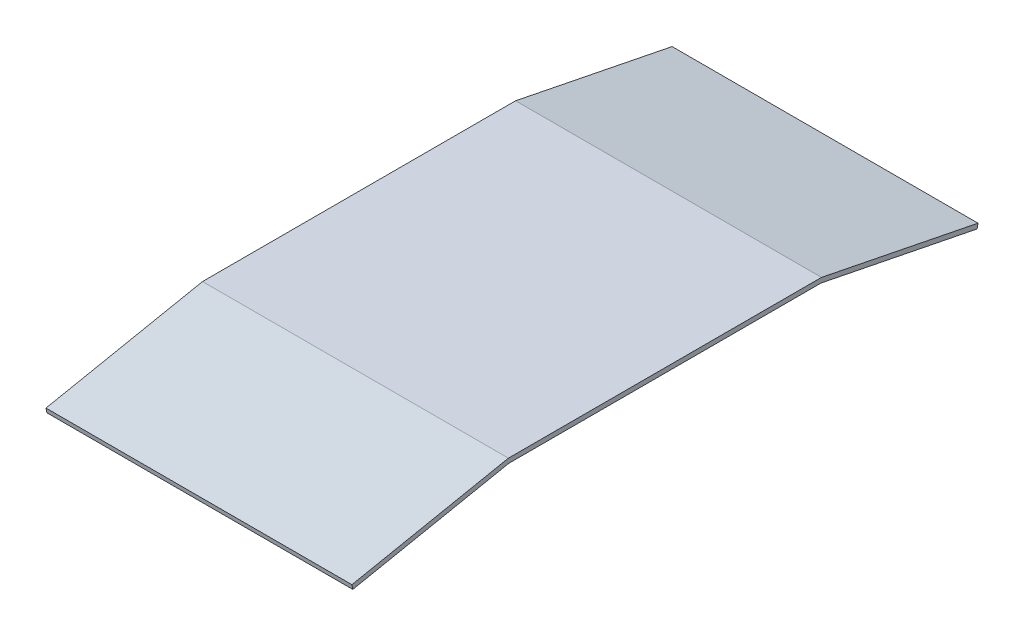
ISO-10303-21;
HEADER;
FILE_DESCRIPTION(('STEP AP214'),'2;1');
FILE_NAME('part.step','',(''),(''),'','','');
FILE_SCHEMA(('AUTOMOTIVE_DESIGN { 1 0 10303 214 1 1 1 1 }'));
ENDSEC;
DATA;
#1=APPLICATION_CONTEXT('core data for automotive mechanical design processes');
#2=APPLICATION_PROTOCOL_DEFINITION('international standard','automotive_design',2000,#1);
#3=PRODUCT_CONTEXT('',#1,'mechanical');
#4=PRODUCT('Part','Part','',(#3));
#5=PRODUCT_RELATED_PRODUCT_CATEGORY('part','',(#4));
#6=PRODUCT_DEFINITION_FORMATION('','',#4);
#7=PRODUCT_DEFINITION_CONTEXT('part definition',#1,'design');
#8=PRODUCT_DEFINITION('design','',#6,#7);
#9=PRODUCT_DEFINITION_SHAPE('','',#8);
#10=(LENGTH_UNIT() NAMED_UNIT(*) SI_UNIT(.MILLI.,.METRE.));
#11=(NAMED_UNIT(*) PLANE_ANGLE_UNIT() SI_UNIT($,.RADIAN.));
#12=(NAMED_UNIT(*) SI_UNIT($,.STERADIAN.) SOLID_ANGLE_UNIT());
#13=UNCERTAINTY_MEASURE_WITH_UNIT(LENGTH_MEASURE(1.E-05),#10,'distance_accuracy_value','');
#14=(GEOMETRIC_REPRESENTATION_CONTEXT(3) GLOBAL_UNCERTAINTY_ASSIGNED_CONTEXT((#13)) GLOBAL_UNIT_ASSIGNED_CONTEXT((#10,
#11,#12)) REPRESENTATION_CONTEXT('',''));
#15=CARTESIAN_POINT('',(0.,0.,0.));
#16=DIRECTION('',(0.,0.,1.));
#17=DIRECTION('',(1.,0.,0.));
#18=AXIS2_PLACEMENT_3D('',#15,#16,#17);
#19=CARTESIAN_POINT('',(196.,20.,100.));
#20=DIRECTION('',(0.,1.,0.));
#21=DIRECTION('',(0.,0.,1.));
#22=AXIS2_PLACEMENT_3D('',#19,#20,#21);
#23=PLANE('',#22);
#24=DIRECTION('',(0.,0.,-1.));
#25=VECTOR('',#24,1.);
#26=CARTESIAN_POINT('',(0.,20.,100.));
#27=LINE('',#26,#25);
#28=CARTESIAN_POINT('',(0.,20.,100.));
#29=VERTEX_POINT('',#28);
#30=CARTESIAN_POINT('',(0.,20.,-100.));
#31=VERTEX_POINT('',#30);
#32=EDGE_CURVE('E132',#29,#31,#27,.T.);
#33=ORIENTED_EDGE('',*,*,#32,.T.);
#34=DIRECTION('',(-1.,0.,0.));
#35=VECTOR('',#34,1.);
#36=CARTESIAN_POINT('',(196.,20.,-100.));
#37=LINE('',#36,#35);
#38=CARTESIAN_POINT('',(196.,20.,-100.));
#39=VERTEX_POINT('',#38);
#40=EDGE_CURVE('E11',#39,#31,#37,.T.);
#41=ORIENTED_EDGE('',*,*,#40,.F.);
#42=DIRECTION('',(0.,0.,-1.));
#43=VECTOR('',#42,1.);
#44=CARTESIAN_POINT('',(196.,20.,100.));
#45=LINE('',#44,#43);
#46=CARTESIAN_POINT('',(196.,20.,100.));
#47=VERTEX_POINT('',#46);
#48=EDGE_CURVE('E146',#47,#39,#45,.T.);
#49=ORIENTED_EDGE('',*,*,#48,.F.);
#50=DIRECTION('',(-1.,0.,0.));
#51=VECTOR('',#50,1.);
#52=CARTESIAN_POINT('',(196.,20.,100.));
#53=LINE('',#52,#51);
#54=EDGE_CURVE('E128',#47,#29,#53,.T.);
#55=ORIENTED_EDGE('',*,*,#54,.T.);
#56=EDGE_LOOP('',(#33,#41,#49,#55));
#57=FACE_BOUND('',#56,.T.);
#58=ADVANCED_FACE('F36',(#57),#23,.F.);
#59=CARTESIAN_POINT('',(196.,20.,-100.));
#60=DIRECTION('',(0.,0.98058067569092,-0.196116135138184));
#61=DIRECTION('',(0.,0.196116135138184,0.98058067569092));
#62=AXIS2_PLACEMENT_3D('',#59,#60,#61);
#63=PLANE('',#62);
#64=DIRECTION('',(0.,-0.196116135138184,-0.98058067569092));
#65=VECTOR('',#64,1.);
#66=CARTESIAN_POINT('',(0.,20.,-100.));
#67=LINE('',#66,#65);
#68=CARTESIAN_POINT('',(0.,0.,-200.));
#69=VERTEX_POINT('',#68);
#70=EDGE_CURVE('E135',#31,#69,#67,.T.);
#71=ORIENTED_EDGE('',*,*,#70,.T.);
#72=DIRECTION('',(-1.,0.,0.));
#73=VECTOR('',#72,1.);
#74=CARTESIAN_POINT('',(196.,0.,-200.));
#75=LINE('',#74,#73);
#76=CARTESIAN_POINT('',(196.,0.,-200.));
#77=VERTEX_POINT('',#76);
#78=EDGE_CURVE('E44',#77,#69,#75,.T.);
#79=ORIENTED_EDGE('',*,*,#78,.F.);
#80=DIRECTION('',(0.,-0.196116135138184,-0.98058067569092));
#81=VECTOR('',#80,1.);
#82=CARTESIAN_POINT('',(196.,20.,-100.));
#83=LINE('',#82,#81);
#84=EDGE_CURVE('E95',#39,#77,#83,.T.);
#85=ORIENTED_EDGE('',*,*,#84,.F.);
#86=ORIENTED_EDGE('',*,*,#40,.T.);
#87=EDGE_LOOP('',(#71,#79,#85,#86));
#88=FACE_BOUND('',#87,.T.);
#89=ADVANCED_FACE('F181',(#88),#63,.F.);
#90=CARTESIAN_POINT('',(196.,0.,-200.));
#91=DIRECTION('',(0.,0.196116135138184,0.98058067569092));
#92=DIRECTION('',(0.,-0.98058067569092,0.196116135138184));
#93=AXIS2_PLACEMENT_3D('',#90,#91,#92);
#94=PLANE('',#93);
#95=DIRECTION('',(0.,0.98058067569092,-0.196116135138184));
#96=VECTOR('',#95,1.);
#97=CARTESIAN_POINT('',(0.,0.,-200.));
#98=LINE('',#97,#96);
#99=CARTESIAN_POINT('',(0.,2.94174202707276,-200.588348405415));
#100=VERTEX_POINT('',#99);
#101=EDGE_CURVE('E137',#69,#100,#98,.T.);
#102=ORIENTED_EDGE('',*,*,#101,.T.);
#103=DIRECTION('',(-1.,0.,0.));
#104=VECTOR('',#103,1.);
#105=CARTESIAN_POINT('',(196.,2.94174202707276,-200.588348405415));
#106=LINE('',#105,#104);
#107=CARTESIAN_POINT('',(196.,2.94174202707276,-200.588348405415));
#108=VERTEX_POINT('',#107);
#109=EDGE_CURVE('E153',#108,#100,#106,.T.);
#110=ORIENTED_EDGE('',*,*,#109,.F.);
#111=DIRECTION('',(0.,0.98058067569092,-0.196116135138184));
#112=VECTOR('',#111,1.);
#113=CARTESIAN_POINT('',(196.,0.,-200.));
#114=LINE('',#113,#112);
#115=EDGE_CURVE('E161',#77,#108,#114,.T.);
#116=ORIENTED_EDGE('',*,*,#115,.F.);
#117=ORIENTED_EDGE('',*,*,#78,.T.);
#118=EDGE_LOOP('',(#102,#110,#116,#117));
#119=FACE_BOUND('',#118,.T.);
#120=ADVANCED_FACE('F159',(#119),#94,.F.);
#121=CARTESIAN_POINT('',(196.,23.,-100.297058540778));
#122=DIRECTION('',(0.,-0.98058067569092,0.196116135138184));
#123=DIRECTION('',(0.,-0.196116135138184,-0.98058067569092));
#124=AXIS2_PLACEMENT_3D('',#121,#122,#123);
#125=PLANE('',#124);
#126=DIRECTION('',(0.,0.196116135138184,0.98058067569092));
#127=VECTOR('',#126,1.);
#128=CARTESIAN_POINT('',(0.,23.,-100.297058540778));
#129=LINE('',#128,#127);
#130=CARTESIAN_POINT('',(0.,23.,-100.297058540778));
#131=VERTEX_POINT('',#130);
#132=EDGE_CURVE('E139',#100,#131,#129,.T.);
#133=ORIENTED_EDGE('',*,*,#132,.T.);
#134=DIRECTION('',(-1.,0.,0.));
#135=VECTOR('',#134,1.);
#136=CARTESIAN_POINT('',(196.,23.,-100.297058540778));
#137=LINE('',#136,#135);
#138=CARTESIAN_POINT('',(196.,23.,-100.297058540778));
#139=VERTEX_POINT('',#138);
#140=EDGE_CURVE('E150',#139,#131,#137,.T.);
#141=ORIENTED_EDGE('',*,*,#140,.F.);
#142=DIRECTION('',(0.,0.196116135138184,0.98058067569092));
#143=VECTOR('',#142,1.);
#144=CARTESIAN_POINT('',(196.,23.,-100.297058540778));
#145=LINE('',#144,#143);
#146=EDGE_CURVE('E173',#108,#139,#145,.T.);
#147=ORIENTED_EDGE('',*,*,#146,.F.);
#148=ORIENTED_EDGE('',*,*,#109,.T.);
#149=EDGE_LOOP('',(#133,#141,#147,#148));
#150=FACE_BOUND('',#149,.T.);
#151=ADVANCED_FACE('F169',(#150),#125,.F.);
#152=CARTESIAN_POINT('',(196.,23.,100.297058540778));
#153=DIRECTION('',(0.,-1.,0.));
#154=DIRECTION('',(0.,0.,-1.));
#155=AXIS2_PLACEMENT_3D('',#152,#153,#154);
#156=PLANE('',#155);
#157=DIRECTION('',(0.,0.,1.));
#158=VECTOR('',#157,1.);
#159=CARTESIAN_POINT('',(0.,23.,100.297058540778));
#160=LINE('',#159,#158);
#161=CARTESIAN_POINT('',(0.,23.,100.297058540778));
#162=VERTEX_POINT('',#161);
#163=EDGE_CURVE('E141',#131,#162,#160,.T.);
#164=ORIENTED_EDGE('',*,*,#163,.T.);
#165=DIRECTION('',(-1.,0.,0.));
#166=VECTOR('',#165,1.);
#167=CARTESIAN_POINT('',(196.,23.,100.297058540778));
#168=LINE('',#167,#166);
#169=CARTESIAN_POINT('',(196.,23.,100.297058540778));
#170=VERTEX_POINT('',#169);
#171=EDGE_CURVE('E123',#170,#162,#168,.T.);
#172=ORIENTED_EDGE('',*,*,#171,.F.);
#173=DIRECTION('',(0.,0.,1.));
#174=VECTOR('',#173,1.);
#175=CARTESIAN_POINT('',(196.,23.,100.297058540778));
#176=LINE('',#175,#174);
#177=EDGE_CURVE('E114',#139,#170,#176,.T.);
#178=ORIENTED_EDGE('',*,*,#177,.F.);
#179=ORIENTED_EDGE('',*,*,#140,.T.);
#180=EDGE_LOOP('',(#164,#172,#178,#179));
#181=FACE_BOUND('',#180,.T.);
#182=ADVANCED_FACE('F172',(#181),#156,.F.);
#183=CARTESIAN_POINT('',(196.,23.,100.297058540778));
#184=DIRECTION('',(0.,-0.98058067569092,-0.196116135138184));
#185=DIRECTION('',(0.,0.196116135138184,-0.98058067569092));
#186=AXIS2_PLACEMENT_3D('',#183,#184,#185);
#187=PLANE('',#186);
#188=DIRECTION('',(0.,-0.196116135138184,0.98058067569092));
#189=VECTOR('',#188,1.);
#190=CARTESIAN_POINT('',(0.,23.,100.297058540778));
#191=LINE('',#190,#189);
#192=CARTESIAN_POINT('',(0.,2.94174202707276,200.588348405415));
#193=VERTEX_POINT('',#192);
#194=EDGE_CURVE('E122',#162,#193,#191,.T.);
#195=ORIENTED_EDGE('',*,*,#194,.T.);
#196=DIRECTION('',(-1.,0.,0.));
#197=VECTOR('',#196,1.);
#198=CARTESIAN_POINT('',(196.,2.94174202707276,200.588348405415));
#199=LINE('',#198,#197);
#200=CARTESIAN_POINT('',(196.,2.94174202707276,200.588348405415));
#201=VERTEX_POINT('',#200);
#202=EDGE_CURVE('E119',#201,#193,#199,.T.);
#203=ORIENTED_EDGE('',*,*,#202,.F.);
#204=DIRECTION('',(0.,-0.196116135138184,0.98058067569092));
#205=VECTOR('',#204,1.);
#206=CARTESIAN_POINT('',(196.,23.,100.297058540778));
#207=LINE('',#206,#205);
#208=EDGE_CURVE('E108',#170,#201,#207,.T.);
#209=ORIENTED_EDGE('',*,*,#208,.F.);
#210=ORIENTED_EDGE('',*,*,#171,.T.);
#211=EDGE_LOOP('',(#195,#203,#209,#210));
#212=FACE_BOUND('',#211,.T.);
#213=ADVANCED_FACE('F120',(#212),#187,.F.);
#214=CARTESIAN_POINT('',(196.,0.,200.));
#215=DIRECTION('',(0.,0.196116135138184,-0.98058067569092));
#216=DIRECTION('',(0.,0.98058067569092,0.196116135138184));
#217=AXIS2_PLACEMENT_3D('',#214,#215,#216);
#218=PLANE('',#217);
#219=DIRECTION('',(0.,-0.98058067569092,-0.196116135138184));
#220=VECTOR('',#219,1.);
#221=CARTESIAN_POINT('',(0.,0.,200.));
#222=LINE('',#221,#220);
#223=CARTESIAN_POINT('',(0.,0.,200.));
#224=VERTEX_POINT('',#223);
#225=EDGE_CURVE('E81',#193,#224,#222,.T.);
#226=ORIENTED_EDGE('',*,*,#225,.T.);
#227=DIRECTION('',(-1.,0.,0.));
#228=VECTOR('',#227,1.);
#229=CARTESIAN_POINT('',(196.,0.,200.));
#230=LINE('',#229,#228);
#231=CARTESIAN_POINT('',(196.,0.,200.));
#232=VERTEX_POINT('',#231);
#233=EDGE_CURVE('E124',#232,#224,#230,.T.);
#234=ORIENTED_EDGE('',*,*,#233,.F.);
#235=DIRECTION('',(0.,-0.98058067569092,-0.196116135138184));
#236=VECTOR('',#235,1.);
#237=CARTESIAN_POINT('',(196.,0.,200.));
#238=LINE('',#237,#236);
#239=EDGE_CURVE('E112',#201,#232,#238,.T.);
#240=ORIENTED_EDGE('',*,*,#239,.F.);
#241=ORIENTED_EDGE('',*,*,#202,.T.);
#242=EDGE_LOOP('',(#226,#234,#240,#241));
#243=FACE_BOUND('',#242,.T.);
#244=ADVANCED_FACE('F126',(#243),#218,.F.);
#245=CARTESIAN_POINT('',(196.,20.,100.));
#246=DIRECTION('',(0.,0.98058067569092,0.196116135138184));
#247=DIRECTION('',(0.,-0.196116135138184,0.98058067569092));
#248=AXIS2_PLACEMENT_3D('',#245,#246,#247);
#249=PLANE('',#248);
#250=DIRECTION('',(0.,0.196116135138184,-0.98058067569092));
#251=VECTOR('',#250,1.);
#252=CARTESIAN_POINT('',(0.,20.,100.));
#253=LINE('',#252,#251);
#254=EDGE_CURVE('E87',#224,#29,#253,.T.);
#255=ORIENTED_EDGE('',*,*,#254,.T.);
#256=ORIENTED_EDGE('',*,*,#54,.F.);
#257=DIRECTION('',(0.,0.196116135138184,-0.98058067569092));
#258=VECTOR('',#257,1.);
#259=CARTESIAN_POINT('',(196.,20.,100.));
#260=LINE('',#259,#258);
#261=EDGE_CURVE('E52',#232,#47,#260,.T.);
#262=ORIENTED_EDGE('',*,*,#261,.F.);
#263=ORIENTED_EDGE('',*,*,#233,.T.);
#264=EDGE_LOOP('',(#255,#256,#262,#263));
#265=FACE_BOUND('',#264,.T.);
#266=ADVANCED_FACE('F197',(#265),#249,.F.);
#267=CARTESIAN_POINT('',(196.,0.,0.));
#268=DIRECTION('',(1.,0.,0.));
#269=DIRECTION('',(0.,0.,-1.));
#270=AXIS2_PLACEMENT_3D('',#267,#268,#269);
#271=PLANE('',#270);
#272=ORIENTED_EDGE('',*,*,#48,.T.);
#273=ORIENTED_EDGE('',*,*,#84,.T.);
#274=ORIENTED_EDGE('',*,*,#115,.T.);
#275=ORIENTED_EDGE('',*,*,#146,.T.);
#276=ORIENTED_EDGE('',*,*,#177,.T.);
#277=ORIENTED_EDGE('',*,*,#208,.T.);
#278=ORIENTED_EDGE('',*,*,#239,.T.);
#279=ORIENTED_EDGE('',*,*,#261,.T.);
#280=EDGE_LOOP('',(#272,#273,#274,#275,#276,#277,#278,#279));
#281=FACE_BOUND('',#280,.T.);
#282=ADVANCED_FACE('F110',(#281),#271,.T.);
#283=CARTESIAN_POINT('',(0.,0.,0.));
#284=DIRECTION('',(1.,0.,0.));
#285=DIRECTION('',(0.,0.,-1.));
#286=AXIS2_PLACEMENT_3D('',#283,#284,#285);
#287=PLANE('',#286);
#288=ORIENTED_EDGE('',*,*,#32,.F.);
#289=ORIENTED_EDGE('',*,*,#254,.F.);
#290=ORIENTED_EDGE('',*,*,#225,.F.);
#291=ORIENTED_EDGE('',*,*,#194,.F.);
#292=ORIENTED_EDGE('',*,*,#163,.F.);
#293=ORIENTED_EDGE('',*,*,#132,.F.);
#294=ORIENTED_EDGE('',*,*,#101,.F.);
#295=ORIENTED_EDGE('',*,*,#70,.F.);
#296=EDGE_LOOP('',(#288,#289,#290,#291,#292,#293,#294,#295));
#297=FACE_BOUND('',#296,.T.);
#298=ADVANCED_FACE('F165',(#297),#287,.F.);
#299=CLOSED_SHELL('',(#58,#89,#120,#151,#182,#213,#244,#266,#282,#298));
#300=MANIFOLD_SOLID_BREP('B2',#299);
#301=ADVANCED_BREP_SHAPE_REPRESENTATION('',(#18,#300),#14);
#302=SHAPE_DEFINITION_REPRESENTATION(#9,#301);
ENDSEC;
END-ISO-10303-21;
